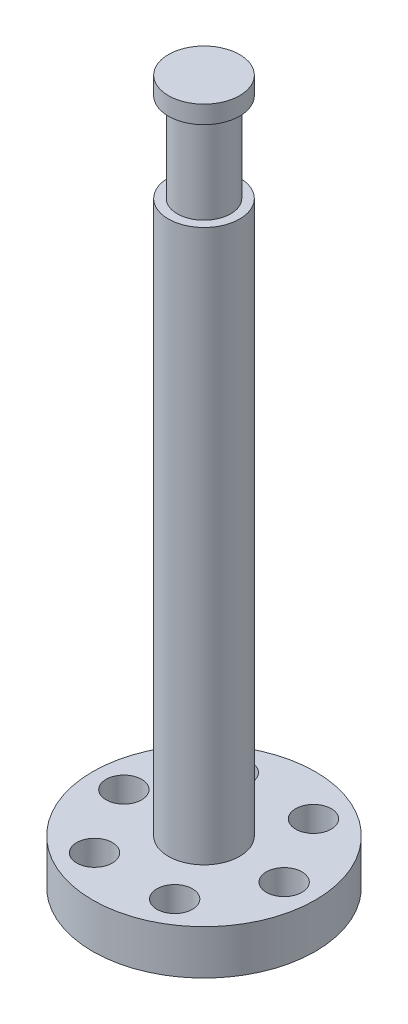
ISO-10303-21;
HEADER;
FILE_DESCRIPTION(('STEP AP214'),'2;1');
FILE_NAME('part.step','',(''),(''),'','','');
FILE_SCHEMA(('AUTOMOTIVE_DESIGN { 1 0 10303 214 1 1 1 1 }'));
ENDSEC;
DATA;
#1=APPLICATION_CONTEXT('core data for automotive mechanical design processes');
#2=APPLICATION_PROTOCOL_DEFINITION('international standard','automotive_design',2000,#1);
#3=PRODUCT_CONTEXT('',#1,'mechanical');
#4=PRODUCT('Part','Part','',(#3));
#5=PRODUCT_RELATED_PRODUCT_CATEGORY('part','',(#4));
#6=PRODUCT_DEFINITION_FORMATION('','',#4);
#7=PRODUCT_DEFINITION_CONTEXT('part definition',#1,'design');
#8=PRODUCT_DEFINITION('design','',#6,#7);
#9=PRODUCT_DEFINITION_SHAPE('','',#8);
#10=(LENGTH_UNIT() NAMED_UNIT(*) SI_UNIT(.MILLI.,.METRE.));
#11=(NAMED_UNIT(*) PLANE_ANGLE_UNIT() SI_UNIT($,.RADIAN.));
#12=(NAMED_UNIT(*) SI_UNIT($,.STERADIAN.) SOLID_ANGLE_UNIT());
#13=UNCERTAINTY_MEASURE_WITH_UNIT(LENGTH_MEASURE(1.E-05),#10,'distance_accuracy_value','');
#14=(GEOMETRIC_REPRESENTATION_CONTEXT(3) GLOBAL_UNCERTAINTY_ASSIGNED_CONTEXT((#13)) GLOBAL_UNIT_ASSIGNED_CONTEXT((#10,
#11,#12)) REPRESENTATION_CONTEXT('',''));
#15=CARTESIAN_POINT('',(0.,0.,0.));
#16=DIRECTION('',(0.,0.,1.));
#17=DIRECTION('',(1.,0.,0.));
#18=AXIS2_PLACEMENT_3D('',#15,#16,#17);
#19=CARTESIAN_POINT('',(0.,5.,0.));
#20=DIRECTION('',(0.,1.,0.));
#21=DIRECTION('',(0.,0.,1.));
#22=AXIS2_PLACEMENT_3D('',#19,#20,#21);
#23=CYLINDRICAL_SURFACE('',#22,4.);
#24=CARTESIAN_POINT('',(0.,5.,0.));
#25=DIRECTION('',(0.,1.,0.));
#26=DIRECTION('',(0.,0.,1.));
#27=AXIS2_PLACEMENT_3D('',#24,#25,#26);
#28=CIRCLE('',#27,4.);
#29=CARTESIAN_POINT('',(0.,5.,4.));
#30=VERTEX_POINT('',#29);
#31=EDGE_CURVE('E54',#30,#30,#28,.T.);
#32=ORIENTED_EDGE('',*,*,#31,.T.);
#33=EDGE_LOOP('',(#32));
#34=FACE_BOUND('',#33,.T.);
#35=CARTESIAN_POINT('',(0.,67.,0.));
#36=DIRECTION('',(0.,1.,0.));
#37=DIRECTION('',(0.,0.,1.));
#38=AXIS2_PLACEMENT_3D('',#35,#36,#37);
#39=CIRCLE('',#38,4.);
#40=CARTESIAN_POINT('',(0.,67.,4.));
#41=VERTEX_POINT('',#40);
#42=EDGE_CURVE('E64',#41,#41,#39,.F.);
#43=ORIENTED_EDGE('',*,*,#42,.T.);
#44=EDGE_LOOP('',(#43));
#45=FACE_BOUND('',#44,.T.);
#46=ADVANCED_FACE('F45',(#34,#45),#23,.T.);
#47=CARTESIAN_POINT('',(0.,79.,0.));
#48=DIRECTION('',(0.,-1.,0.));
#49=DIRECTION('',(0.,0.,-1.));
#50=AXIS2_PLACEMENT_3D('',#47,#48,#49);
#51=CYLINDRICAL_SURFACE('',#50,12.5);
#52=CARTESIAN_POINT('',(0.,0.,0.));
#53=DIRECTION('',(0.,1.,0.));
#54=DIRECTION('',(0.,0.,1.));
#55=AXIS2_PLACEMENT_3D('',#52,#53,#54);
#56=CIRCLE('',#55,12.5);
#57=CARTESIAN_POINT('',(0.,0.,12.5));
#58=VERTEX_POINT('',#57);
#59=EDGE_CURVE('E11',#58,#58,#56,.T.);
#60=ORIENTED_EDGE('',*,*,#59,.T.);
#61=EDGE_LOOP('',(#60));
#62=FACE_BOUND('',#61,.T.);
#63=CARTESIAN_POINT('',(0.,5.,0.));
#64=DIRECTION('',(0.,1.,0.));
#65=DIRECTION('',(0.,0.,1.));
#66=AXIS2_PLACEMENT_3D('',#63,#64,#65);
#67=CIRCLE('',#66,12.5);
#68=CARTESIAN_POINT('',(0.,5.,12.5));
#69=VERTEX_POINT('',#68);
#70=EDGE_CURVE('E49',#69,#69,#67,.T.);
#71=ORIENTED_EDGE('',*,*,#70,.F.);
#72=EDGE_LOOP('',(#71));
#73=FACE_BOUND('',#72,.T.);
#74=ADVANCED_FACE('F42',(#62,#73),#51,.T.);
#75=CARTESIAN_POINT('',(0.,0.,0.));
#76=DIRECTION('',(0.,1.,0.));
#77=DIRECTION('',(0.,0.,1.));
#78=AXIS2_PLACEMENT_3D('',#75,#76,#77);
#79=PLANE('',#78);
#80=CARTESIAN_POINT('',(4.50000000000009,0.,7.79422863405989));
#81=DIRECTION('',(0.,-1.,0.));
#82=DIRECTION('',(0.866025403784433,0.,-0.50000000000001));
#83=AXIS2_PLACEMENT_3D('',#80,#81,#82);
#84=CIRCLE('',#83,2.);
#85=CARTESIAN_POINT('',(6.23205080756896,0.,6.79422863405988));
#86=VERTEX_POINT('',#85);
#87=EDGE_CURVE('E229',#86,#86,#84,.T.);
#88=ORIENTED_EDGE('',*,*,#87,.F.);
#89=EDGE_LOOP('',(#88));
#90=FACE_BOUND('',#89,.T.);
#91=CARTESIAN_POINT('',(-4.49999999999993,0.,7.79422863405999));
#92=DIRECTION('',(0.,-1.,0.));
#93=DIRECTION('',(0.866025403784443,0.,0.499999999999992));
#94=AXIS2_PLACEMENT_3D('',#91,#92,#93);
#95=CIRCLE('',#94,2.);
#96=CARTESIAN_POINT('',(-2.76794919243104,0.,8.79422863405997));
#97=VERTEX_POINT('',#96);
#98=EDGE_CURVE('E232',#97,#97,#95,.T.);
#99=ORIENTED_EDGE('',*,*,#98,.F.);
#100=EDGE_LOOP('',(#99));
#101=FACE_BOUND('',#100,.T.);
#102=CARTESIAN_POINT('',(-9.,0.,0.));
#103=DIRECTION('',(0.,-1.,0.));
#104=DIRECTION('',(0.,0.,1.));
#105=AXIS2_PLACEMENT_3D('',#102,#103,#104);
#106=CIRCLE('',#105,2.);
#107=CARTESIAN_POINT('',(-9.,0.,2.));
#108=VERTEX_POINT('',#107);
#109=EDGE_CURVE('E231',#108,#108,#106,.T.);
#110=ORIENTED_EDGE('',*,*,#109,.F.);
#111=EDGE_LOOP('',(#110));
#112=FACE_BOUND('',#111,.T.);
#113=CARTESIAN_POINT('',(-4.50000000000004,0.,-7.79422863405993));
#114=DIRECTION('',(0.,-1.,0.));
#115=DIRECTION('',(-0.866025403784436,0.,0.500000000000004));
#116=AXIS2_PLACEMENT_3D('',#113,#114,#115);
#117=CIRCLE('',#116,2.);
#118=CARTESIAN_POINT('',(-6.23205080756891,0.,-6.79422863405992));
#119=VERTEX_POINT('',#118);
#120=EDGE_CURVE('E239',#119,#119,#117,.T.);
#121=ORIENTED_EDGE('',*,*,#120,.F.);
#122=EDGE_LOOP('',(#121));
#123=FACE_BOUND('',#122,.T.);
#124=CARTESIAN_POINT('',(4.49999999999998,0.,-7.79422863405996));
#125=DIRECTION('',(0.,-1.,0.));
#126=DIRECTION('',(-0.86602540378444,0.,-0.499999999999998));
#127=AXIS2_PLACEMENT_3D('',#124,#125,#126);
#128=CIRCLE('',#127,2.);
#129=CARTESIAN_POINT('',(2.7679491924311,0.,-8.79422863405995));
#130=VERTEX_POINT('',#129);
#131=EDGE_CURVE('E80',#130,#130,#128,.T.);
#132=ORIENTED_EDGE('',*,*,#131,.F.);
#133=EDGE_LOOP('',(#132));
#134=FACE_BOUND('',#133,.T.);
#135=CARTESIAN_POINT('',(9.,0.,0.));
#136=DIRECTION('',(0.,-1.,0.));
#137=DIRECTION('',(0.,0.,-1.));
#138=AXIS2_PLACEMENT_3D('',#135,#136,#137);
#139=CIRCLE('',#138,2.);
#140=CARTESIAN_POINT('',(9.,0.,-2.));
#141=VERTEX_POINT('',#140);
#142=EDGE_CURVE('E75',#141,#141,#139,.T.);
#143=ORIENTED_EDGE('',*,*,#142,.F.);
#144=EDGE_LOOP('',(#143));
#145=FACE_BOUND('',#144,.T.);
#146=ORIENTED_EDGE('',*,*,#59,.F.);
#147=EDGE_LOOP('',(#146));
#148=FACE_BOUND('',#147,.T.);
#149=ADVANCED_FACE('F113',(#90,#101,#112,#123,#134,#145,#148),#79,.F.);
#150=CARTESIAN_POINT('',(0.,5.,0.));
#151=DIRECTION('',(0.,1.,0.));
#152=DIRECTION('',(0.,0.,1.));
#153=AXIS2_PLACEMENT_3D('',#150,#151,#152);
#154=PLANE('',#153);
#155=CARTESIAN_POINT('',(4.50000000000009,5.,7.79422863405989));
#156=DIRECTION('',(0.,1.,0.));
#157=DIRECTION('',(0.,0.,1.));
#158=AXIS2_PLACEMENT_3D('',#155,#156,#157);
#159=CIRCLE('',#158,2.);
#160=CARTESIAN_POINT('',(4.50000000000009,5.,9.79422863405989));
#161=VERTEX_POINT('',#160);
#162=EDGE_CURVE('E46',#161,#161,#159,.T.);
#163=ORIENTED_EDGE('',*,*,#162,.F.);
#164=EDGE_LOOP('',(#163));
#165=FACE_BOUND('',#164,.T.);
#166=CARTESIAN_POINT('',(-4.49999999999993,5.,7.79422863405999));
#167=DIRECTION('',(0.,1.,0.));
#168=DIRECTION('',(0.,0.,1.));
#169=AXIS2_PLACEMENT_3D('',#166,#167,#168);
#170=CIRCLE('',#169,2.);
#171=CARTESIAN_POINT('',(-4.49999999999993,5.,9.79422863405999));
#172=VERTEX_POINT('',#171);
#173=EDGE_CURVE('E85',#172,#172,#170,.T.);
#174=ORIENTED_EDGE('',*,*,#173,.F.);
#175=EDGE_LOOP('',(#174));
#176=FACE_BOUND('',#175,.T.);
#177=CARTESIAN_POINT('',(-9.,5.,0.));
#178=DIRECTION('',(0.,1.,0.));
#179=DIRECTION('',(0.,0.,1.));
#180=AXIS2_PLACEMENT_3D('',#177,#178,#179);
#181=CIRCLE('',#180,2.);
#182=CARTESIAN_POINT('',(-9.,5.,2.));
#183=VERTEX_POINT('',#182);
#184=EDGE_CURVE('E79',#183,#183,#181,.T.);
#185=ORIENTED_EDGE('',*,*,#184,.F.);
#186=EDGE_LOOP('',(#185));
#187=FACE_BOUND('',#186,.T.);
#188=CARTESIAN_POINT('',(-4.50000000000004,5.,-7.79422863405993));
#189=DIRECTION('',(0.,1.,0.));
#190=DIRECTION('',(0.,0.,1.));
#191=AXIS2_PLACEMENT_3D('',#188,#189,#190);
#192=CIRCLE('',#191,2.);
#193=CARTESIAN_POINT('',(-4.50000000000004,5.,-5.79422863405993));
#194=VERTEX_POINT('',#193);
#195=EDGE_CURVE('E78',#194,#194,#192,.T.);
#196=ORIENTED_EDGE('',*,*,#195,.F.);
#197=EDGE_LOOP('',(#196));
#198=FACE_BOUND('',#197,.T.);
#199=CARTESIAN_POINT('',(4.49999999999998,5.,-7.79422863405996));
#200=DIRECTION('',(0.,1.,0.));
#201=DIRECTION('',(0.,0.,1.));
#202=AXIS2_PLACEMENT_3D('',#199,#200,#201);
#203=CIRCLE('',#202,2.);
#204=CARTESIAN_POINT('',(4.49999999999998,5.,-5.79422863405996));
#205=VERTEX_POINT('',#204);
#206=EDGE_CURVE('E72',#205,#205,#203,.T.);
#207=ORIENTED_EDGE('',*,*,#206,.F.);
#208=EDGE_LOOP('',(#207));
#209=FACE_BOUND('',#208,.T.);
#210=CARTESIAN_POINT('',(9.,5.,0.));
#211=DIRECTION('',(0.,1.,0.));
#212=DIRECTION('',(0.,0.,1.));
#213=AXIS2_PLACEMENT_3D('',#210,#211,#212);
#214=CIRCLE('',#213,2.);
#215=CARTESIAN_POINT('',(9.,5.,2.));
#216=VERTEX_POINT('',#215);
#217=EDGE_CURVE('E68',#216,#216,#214,.T.);
#218=ORIENTED_EDGE('',*,*,#217,.F.);
#219=EDGE_LOOP('',(#218));
#220=FACE_BOUND('',#219,.T.);
#221=ORIENTED_EDGE('',*,*,#31,.F.);
#222=EDGE_LOOP('',(#221));
#223=FACE_BOUND('',#222,.T.);
#224=ORIENTED_EDGE('',*,*,#70,.T.);
#225=EDGE_LOOP('',(#224));
#226=FACE_BOUND('',#225,.T.);
#227=ADVANCED_FACE('F107',(#165,#176,#187,#198,#209,#220,#223,#226),#154,.T.);
#228=CARTESIAN_POINT('',(0.,67.,0.));
#229=DIRECTION('',(0.,1.,0.));
#230=DIRECTION('',(0.,0.,1.));
#231=AXIS2_PLACEMENT_3D('',#228,#229,#230);
#232=PLANE('',#231);
#233=ORIENTED_EDGE('',*,*,#42,.F.);
#234=EDGE_LOOP('',(#233));
#235=FACE_BOUND('',#234,.T.);
#236=CARTESIAN_POINT('',(0.,67.,0.));
#237=DIRECTION('',(0.,1.,0.));
#238=DIRECTION('',(0.,0.,1.));
#239=AXIS2_PLACEMENT_3D('',#236,#237,#238);
#240=CIRCLE('',#239,3.);
#241=CARTESIAN_POINT('',(0.,67.,3.));
#242=VERTEX_POINT('',#241);
#243=EDGE_CURVE('E61',#242,#242,#240,.T.);
#244=ORIENTED_EDGE('',*,*,#243,.F.);
#245=EDGE_LOOP('',(#244));
#246=FACE_BOUND('',#245,.T.);
#247=ADVANCED_FACE('F109',(#235,#246),#232,.T.);
#248=CARTESIAN_POINT('',(0.,77.,0.));
#249=DIRECTION('',(0.,1.,0.));
#250=DIRECTION('',(0.,0.,1.));
#251=AXIS2_PLACEMENT_3D('',#248,#249,#250);
#252=PLANE('',#251);
#253=CARTESIAN_POINT('',(0.,77.,0.));
#254=DIRECTION('',(0.,1.,0.));
#255=DIRECTION('',(0.,0.,1.));
#256=AXIS2_PLACEMENT_3D('',#253,#254,#255);
#257=CIRCLE('',#256,4.);
#258=CARTESIAN_POINT('',(0.,77.,4.));
#259=VERTEX_POINT('',#258);
#260=EDGE_CURVE('E58',#259,#259,#257,.F.);
#261=ORIENTED_EDGE('',*,*,#260,.T.);
#262=EDGE_LOOP('',(#261));
#263=FACE_BOUND('',#262,.T.);
#264=CARTESIAN_POINT('',(0.,77.,0.));
#265=DIRECTION('',(0.,1.,0.));
#266=DIRECTION('',(0.,0.,1.));
#267=AXIS2_PLACEMENT_3D('',#264,#265,#266);
#268=CIRCLE('',#267,3.);
#269=CARTESIAN_POINT('',(0.,77.,3.));
#270=VERTEX_POINT('',#269);
#271=EDGE_CURVE('E71',#270,#270,#268,.T.);
#272=ORIENTED_EDGE('',*,*,#271,.T.);
#273=EDGE_LOOP('',(#272));
#274=FACE_BOUND('',#273,.T.);
#275=ADVANCED_FACE('F144',(#263,#274),#252,.F.);
#276=CARTESIAN_POINT('',(0.,67.,0.));
#277=DIRECTION('',(0.,1.,0.));
#278=DIRECTION('',(0.,0.,1.));
#279=AXIS2_PLACEMENT_3D('',#276,#277,#278);
#280=CYLINDRICAL_SURFACE('',#279,3.);
#281=ORIENTED_EDGE('',*,*,#243,.T.);
#282=EDGE_LOOP('',(#281));
#283=FACE_BOUND('',#282,.T.);
#284=ORIENTED_EDGE('',*,*,#271,.F.);
#285=EDGE_LOOP('',(#284));
#286=FACE_BOUND('',#285,.T.);
#287=ADVANCED_FACE('F138',(#283,#286),#280,.T.);
#288=CARTESIAN_POINT('',(0.,79.,0.));
#289=DIRECTION('',(0.,1.,0.));
#290=DIRECTION('',(0.,0.,1.));
#291=AXIS2_PLACEMENT_3D('',#288,#289,#290);
#292=PLANE('',#291);
#293=CARTESIAN_POINT('',(0.,79.,0.));
#294=DIRECTION('',(0.,1.,0.));
#295=DIRECTION('',(0.,0.,1.));
#296=AXIS2_PLACEMENT_3D('',#293,#294,#295);
#297=CIRCLE('',#296,4.);
#298=CARTESIAN_POINT('',(0.,79.,4.));
#299=VERTEX_POINT('',#298);
#300=EDGE_CURVE('E70',#299,#299,#297,.T.);
#301=ORIENTED_EDGE('',*,*,#300,.T.);
#302=EDGE_LOOP('',(#301));
#303=FACE_BOUND('',#302,.T.);
#304=ADVANCED_FACE('F132',(#303),#292,.T.);
#305=ORIENTED_EDGE('',*,*,#260,.F.);
#306=EDGE_LOOP('',(#305));
#307=FACE_BOUND('',#306,.T.);
#308=ORIENTED_EDGE('',*,*,#300,.F.);
#309=EDGE_LOOP('',(#308));
#310=FACE_BOUND('',#309,.T.);
#311=ADVANCED_FACE('F122',(#307,#310),#23,.T.);
#312=CARTESIAN_POINT('',(9.,79.,0.));
#313=DIRECTION('',(0.,-1.,0.));
#314=DIRECTION('',(0.,0.,-1.));
#315=AXIS2_PLACEMENT_3D('',#312,#313,#314);
#316=CYLINDRICAL_SURFACE('',#315,2.);
#317=ORIENTED_EDGE('',*,*,#217,.T.);
#318=EDGE_LOOP('',(#317));
#319=FACE_BOUND('',#318,.T.);
#320=ORIENTED_EDGE('',*,*,#142,.T.);
#321=EDGE_LOOP('',(#320));
#322=FACE_BOUND('',#321,.T.);
#323=ADVANCED_FACE('F129',(#319,#322),#316,.F.);
#324=CARTESIAN_POINT('',(4.49999999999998,79.,-7.79422863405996));
#325=DIRECTION('',(0.,-1.,0.));
#326=DIRECTION('',(0.,0.,-1.));
#327=AXIS2_PLACEMENT_3D('',#324,#325,#326);
#328=CYLINDRICAL_SURFACE('',#327,2.);
#329=ORIENTED_EDGE('',*,*,#206,.T.);
#330=EDGE_LOOP('',(#329));
#331=FACE_BOUND('',#330,.T.);
#332=ORIENTED_EDGE('',*,*,#131,.T.);
#333=EDGE_LOOP('',(#332));
#334=FACE_BOUND('',#333,.T.);
#335=ADVANCED_FACE('F140',(#331,#334),#328,.F.);
#336=CARTESIAN_POINT('',(-4.50000000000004,79.,-7.79422863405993));
#337=DIRECTION('',(0.,-1.,0.));
#338=DIRECTION('',(0.,0.,-1.));
#339=AXIS2_PLACEMENT_3D('',#336,#337,#338);
#340=CYLINDRICAL_SURFACE('',#339,2.);
#341=ORIENTED_EDGE('',*,*,#195,.T.);
#342=EDGE_LOOP('',(#341));
#343=FACE_BOUND('',#342,.T.);
#344=ORIENTED_EDGE('',*,*,#120,.T.);
#345=EDGE_LOOP('',(#344));
#346=FACE_BOUND('',#345,.T.);
#347=ADVANCED_FACE('F190',(#343,#346),#340,.F.);
#348=CARTESIAN_POINT('',(-9.,79.,0.));
#349=DIRECTION('',(0.,-1.,0.));
#350=DIRECTION('',(0.,0.,-1.));
#351=AXIS2_PLACEMENT_3D('',#348,#349,#350);
#352=CYLINDRICAL_SURFACE('',#351,2.);
#353=ORIENTED_EDGE('',*,*,#184,.T.);
#354=EDGE_LOOP('',(#353));
#355=FACE_BOUND('',#354,.T.);
#356=ORIENTED_EDGE('',*,*,#109,.T.);
#357=EDGE_LOOP('',(#356));
#358=FACE_BOUND('',#357,.T.);
#359=ADVANCED_FACE('F196',(#355,#358),#352,.F.);
#360=CARTESIAN_POINT('',(-4.49999999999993,79.,7.79422863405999));
#361=DIRECTION('',(0.,-1.,0.));
#362=DIRECTION('',(0.,0.,-1.));
#363=AXIS2_PLACEMENT_3D('',#360,#361,#362);
#364=CYLINDRICAL_SURFACE('',#363,2.);
#365=ORIENTED_EDGE('',*,*,#173,.T.);
#366=EDGE_LOOP('',(#365));
#367=FACE_BOUND('',#366,.T.);
#368=ORIENTED_EDGE('',*,*,#98,.T.);
#369=EDGE_LOOP('',(#368));
#370=FACE_BOUND('',#369,.T.);
#371=ADVANCED_FACE('F207',(#367,#370),#364,.F.);
#372=CARTESIAN_POINT('',(4.50000000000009,79.,7.79422863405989));
#373=DIRECTION('',(0.,-1.,0.));
#374=DIRECTION('',(0.,0.,-1.));
#375=AXIS2_PLACEMENT_3D('',#372,#373,#374);
#376=CYLINDRICAL_SURFACE('',#375,2.);
#377=ORIENTED_EDGE('',*,*,#162,.T.);
#378=EDGE_LOOP('',(#377));
#379=FACE_BOUND('',#378,.T.);
#380=ORIENTED_EDGE('',*,*,#87,.T.);
#381=EDGE_LOOP('',(#380));
#382=FACE_BOUND('',#381,.T.);
#383=ADVANCED_FACE('F216',(#379,#382),#376,.F.);
#384=CLOSED_SHELL('',(#46,#74,#149,#227,#247,#275,#287,#304,#311,#323,#335,#347,#359,#371,#383));
#385=MANIFOLD_SOLID_BREP('B2',#384);
#386=ADVANCED_BREP_SHAPE_REPRESENTATION('',(#18,#385),#14);
#387=SHAPE_DEFINITION_REPRESENTATION(#9,#386);
ENDSEC;
END-ISO-10303-21;
